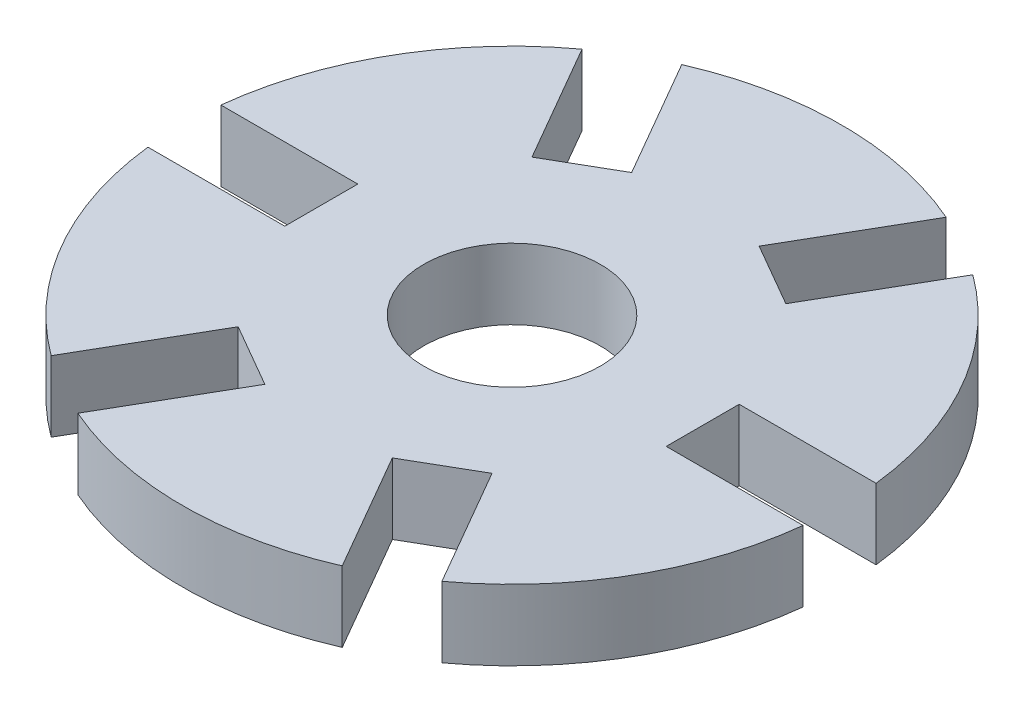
from build123d import *

# Parameters (mm, degrees)
SKETCH1_R                 = 28
BOSS_EXTRUDE1_DEPTH       = 6
SKETCH2_R                 = 7.5
CENTRAL_BORE_DEPTH        = 41.049968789
BEARING_WEDGE_SLOTS_REACH = 42.05
SKETCH4_W                 = 11.8
SKETCH4_H                 = 6.2
WEDGE_SLOT_PATTERN_COUNT  = 6


with BuildPart() as part:
    # Sketch1 → Boss-Extrude1 (new body)
    with BuildSketch(Plane(origin=(0, 0, 0), x_dir=(1, 0, 0), z_dir=(0, 1, 0))):
        with Locations(Location((0, 0, 0), (0, 0, 90))):
            Circle(SKETCH1_R)
    extrude(amount=BOSS_EXTRUDE1_DEPTH)

    # Sketch2 → central bore (cut, through all)
    with BuildSketch(Plane(origin=(0, 6, 0), x_dir=(1, 0, 0), z_dir=(0, 1, 0))):
        with Locations(Location((0, 0, 0), (0, 0, 270))):
            Circle(SKETCH2_R)
    extrude(amount=-CENTRAL_BORE_DEPTH, mode=Mode.SUBTRACT)

    # Sketch4 → bearing wedge slots (cut, up to next)
    with BuildSketch(Plane(origin=(0, 6, 0), x_dir=(1, 0, 0), z_dir=(0, 1, 0)), mode=Mode.PRIVATE) as bearing_wedge_slots_sk1:
        with Locations((22.1, 0)):
            Rectangle(SKETCH4_W, SKETCH4_H)
    bearing_wedge_slots_tool1 = extrude(bearing_wedge_slots_sk1.sketch, amount=-BEARING_WEDGE_SLOTS_REACH, mode=Mode.PRIVATE) & part.part
    bearing_wedge_slots = bearing_wedge_slots_tool1.solids().sort_by_distance((22.1, 6, 0))[0]
    add(bearing_wedge_slots, mode=Mode.SUBTRACT)

    # wedge slot pattern: bearing wedge slots ×6 about axis
    wedge_slot_pattern_axis = Axis((0, 0, 0), (0, 1, 0))
    for i in range(1, WEDGE_SLOT_PATTERN_COUNT):
        add(bearing_wedge_slots.rotate(wedge_slot_pattern_axis, i * 360 / WEDGE_SLOT_PATTERN_COUNT), mode=Mode.SUBTRACT)


solid = part.part
